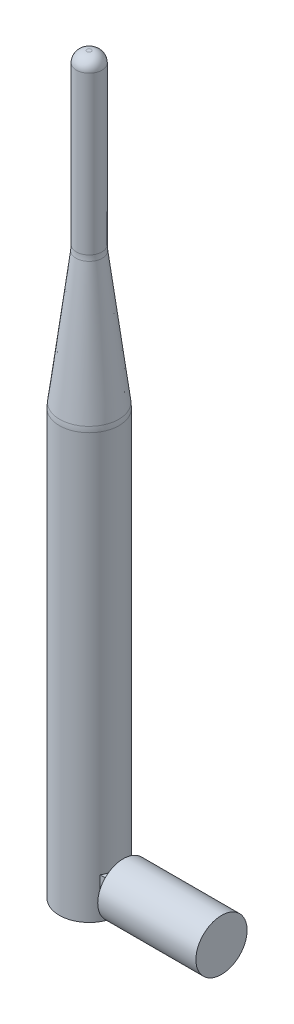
ISO-10303-21;
HEADER;
FILE_DESCRIPTION(('STEP AP214'),'2;1');
FILE_NAME('part.step','',(''),(''),'','','');
FILE_SCHEMA(('AUTOMOTIVE_DESIGN { 1 0 10303 214 1 1 1 1 }'));
ENDSEC;
DATA;
#1=APPLICATION_CONTEXT('core data for automotive mechanical design processes');
#2=APPLICATION_PROTOCOL_DEFINITION('international standard','automotive_design',2000,#1);
#3=PRODUCT_CONTEXT('',#1,'mechanical');
#4=PRODUCT('Part','Part','',(#3));
#5=PRODUCT_RELATED_PRODUCT_CATEGORY('part','',(#4));
#6=PRODUCT_DEFINITION_FORMATION('','',#4);
#7=PRODUCT_DEFINITION_CONTEXT('part definition',#1,'design');
#8=PRODUCT_DEFINITION('design','',#6,#7);
#9=PRODUCT_DEFINITION_SHAPE('','',#8);
#10=(LENGTH_UNIT() NAMED_UNIT(*) SI_UNIT(.MILLI.,.METRE.));
#11=(NAMED_UNIT(*) PLANE_ANGLE_UNIT() SI_UNIT($,.RADIAN.));
#12=(NAMED_UNIT(*) SI_UNIT($,.STERADIAN.) SOLID_ANGLE_UNIT());
#13=UNCERTAINTY_MEASURE_WITH_UNIT(LENGTH_MEASURE(1.E-05),#10,'distance_accuracy_value','');
#14=(GEOMETRIC_REPRESENTATION_CONTEXT(3) GLOBAL_UNCERTAINTY_ASSIGNED_CONTEXT((#13)) GLOBAL_UNIT_ASSIGNED_CONTEXT((#10,
#11,#12)) REPRESENTATION_CONTEXT('',''));
#15=CARTESIAN_POINT('',(0.,0.,0.));
#16=DIRECTION('',(0.,0.,1.));
#17=DIRECTION('',(1.,0.,0.));
#18=AXIS2_PLACEMENT_3D('',#15,#16,#17);
#19=CARTESIAN_POINT('',(0.,0.,0.));
#20=DIRECTION('',(0.,-1.,0.));
#21=DIRECTION('',(0.,0.,-1.));
#22=AXIS2_PLACEMENT_3D('',#19,#20,#21);
#23=CYLINDRICAL_SURFACE('',#22,7.);
#24=CARTESIAN_POINT('',(0.,99.3774225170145,0.));
#25=DIRECTION('',(0.,-1.,0.));
#26=DIRECTION('',(0.,0.,-1.));
#27=AXIS2_PLACEMENT_3D('',#24,#25,#26);
#28=CIRCLE('',#27,7.);
#29=CARTESIAN_POINT('',(0.,99.3774225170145,-7.));
#30=VERTEX_POINT('',#29);
#31=EDGE_CURVE('E118',#30,#30,#28,.T.);
#32=ORIENTED_EDGE('',*,*,#31,.T.);
#33=EDGE_LOOP('',(#32));
#34=FACE_BOUND('',#33,.T.);
#35=CARTESIAN_POINT('',(0.,0.,0.));
#36=DIRECTION('',(0.,-1.,0.));
#37=DIRECTION('',(0.,0.,-1.));
#38=AXIS2_PLACEMENT_3D('',#35,#36,#37);
#39=CIRCLE('',#38,7.);
#40=CARTESIAN_POINT('',(0.,0.,-7.));
#41=VERTEX_POINT('',#40);
#42=EDGE_CURVE('E121',#41,#41,#39,.T.);
#43=ORIENTED_EDGE('',*,*,#42,.F.);
#44=EDGE_LOOP('',(#43));
#45=FACE_BOUND('',#44,.T.);
#46=CARTESIAN_POINT('',(0.,2.5,0.));
#47=DIRECTION('',(0.,1.,0.));
#48=DIRECTION('',(0.,0.,1.));
#49=AXIS2_PLACEMENT_3D('',#46,#47,#48);
#50=CIRCLE('',#49,7.);
#51=CARTESIAN_POINT('',(6.06217782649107,2.5,-3.5));
#52=VERTEX_POINT('',#51);
#53=CARTESIAN_POINT('',(6.06217782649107,2.5,3.5));
#54=VERTEX_POINT('',#53);
#55=EDGE_CURVE('E124',#52,#54,#50,.F.);
#56=ORIENTED_EDGE('',*,*,#55,.T.);
#57=DIRECTION('',(0.,-1.,0.));
#58=VECTOR('',#57,1.);
#59=CARTESIAN_POINT('',(6.06217782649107,0.,3.5));
#60=LINE('',#59,#58);
#61=CARTESIAN_POINT('',(6.06217782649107,9.5,3.5));
#62=VERTEX_POINT('',#61);
#63=EDGE_CURVE('E11',#54,#62,#60,.F.);
#64=ORIENTED_EDGE('',*,*,#63,.T.);
#65=CARTESIAN_POINT('',(0.,9.5,0.));
#66=DIRECTION('',(0.,-1.,0.));
#67=DIRECTION('',(0.,0.,-1.));
#68=AXIS2_PLACEMENT_3D('',#65,#66,#67);
#69=CIRCLE('',#68,7.);
#70=CARTESIAN_POINT('',(6.06217782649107,9.5,-3.5));
#71=VERTEX_POINT('',#70);
#72=EDGE_CURVE('E40',#62,#71,#69,.F.);
#73=ORIENTED_EDGE('',*,*,#72,.T.);
#74=DIRECTION('',(0.,-1.,0.));
#75=VECTOR('',#74,1.);
#76=CARTESIAN_POINT('',(6.06217782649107,0.,-3.5));
#77=LINE('',#76,#75);
#78=EDGE_CURVE('E127',#71,#52,#77,.T.);
#79=ORIENTED_EDGE('',*,*,#78,.T.);
#80=EDGE_LOOP('',(#56,#64,#73,#79));
#81=FACE_BOUND('',#80,.T.);
#82=ADVANCED_FACE('F32',(#34,#45,#81),#23,.T.);
#83=CARTESIAN_POINT('',(0.,0.,0.));
#84=DIRECTION('',(0.,-1.,0.));
#85=DIRECTION('',(0.,0.,-1.));
#86=AXIS2_PLACEMENT_3D('',#83,#84,#85);
#87=PLANE('',#86);
#88=ORIENTED_EDGE('',*,*,#42,.T.);
#89=EDGE_LOOP('',(#88));
#90=FACE_BOUND('',#89,.T.);
#91=ADVANCED_FACE('F34',(#90),#87,.T.);
#92=CARTESIAN_POINT('',(0.,99.3774225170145,0.));
#93=DIRECTION('',(0.,-1.,0.));
#94=DIRECTION('',(0.,0.,-1.));
#95=AXIS2_PLACEMENT_3D('',#92,#93,#94);
#96=DEGENERATE_TOROIDAL_SURFACE('',#95,3.,10.,.F.);
#97=CARTESIAN_POINT('',(0.,100.617769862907,0.));
#98=DIRECTION('',(0.,-1.,0.));
#99=DIRECTION('',(0.,0.,-1.));
#100=AXIS2_PLACEMENT_3D('',#97,#98,#99);
#101=CIRCLE('',#100,6.92277876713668);
#102=CARTESIAN_POINT('',(0.,100.617769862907,-6.92277876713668));
#103=VERTEX_POINT('',#102);
#104=EDGE_CURVE('E115',#103,#103,#101,.T.);
#105=ORIENTED_EDGE('',*,*,#104,.T.);
#106=EDGE_LOOP('',(#105));
#107=FACE_BOUND('',#106,.T.);
#108=ORIENTED_EDGE('',*,*,#31,.F.);
#109=EDGE_LOOP('',(#108));
#110=FACE_BOUND('',#109,.T.);
#111=ADVANCED_FACE('F147',(#107,#110),#96,.F.);
#112=CARTESIAN_POINT('',(0.,100.617769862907,0.));
#113=DIRECTION('',(0.,-1.,0.));
#114=DIRECTION('',(0.,0.,-1.));
#115=AXIS2_PLACEMENT_3D('',#112,#113,#114);
#116=CONICAL_SURFACE('',#115,6.92277876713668,0.124354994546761);
#117=CARTESIAN_POINT('',(0.,131.382230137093,0.));
#118=DIRECTION('',(0.,-1.,0.));
#119=DIRECTION('',(0.,0.,-1.));
#120=AXIS2_PLACEMENT_3D('',#117,#118,#119);
#121=CIRCLE('',#120,3.07722123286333);
#122=CARTESIAN_POINT('',(0.,131.382230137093,-3.07722123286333));
#123=VERTEX_POINT('',#122);
#124=EDGE_CURVE('E112',#123,#123,#121,.T.);
#125=ORIENTED_EDGE('',*,*,#124,.T.);
#126=EDGE_LOOP('',(#125));
#127=FACE_BOUND('',#126,.T.);
#128=ORIENTED_EDGE('',*,*,#104,.F.);
#129=EDGE_LOOP('',(#128));
#130=FACE_BOUND('',#129,.T.);
#131=ADVANCED_FACE('F153',(#127,#130),#116,.T.);
#132=CARTESIAN_POINT('',(0.,132.622577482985,0.));
#133=DIRECTION('',(0.,-1.,0.));
#134=DIRECTION('',(0.,0.,-1.));
#135=AXIS2_PLACEMENT_3D('',#132,#133,#134);
#136=TOROIDAL_SURFACE('',#135,13.,10.);
#137=CARTESIAN_POINT('',(0.,132.622577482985,0.));
#138=DIRECTION('',(0.,-1.,0.));
#139=DIRECTION('',(0.,0.,-1.));
#140=AXIS2_PLACEMENT_3D('',#137,#138,#139);
#141=CIRCLE('',#140,3.);
#142=CARTESIAN_POINT('',(0.,132.622577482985,-3.));
#143=VERTEX_POINT('',#142);
#144=EDGE_CURVE('E109',#143,#143,#141,.T.);
#145=ORIENTED_EDGE('',*,*,#144,.T.);
#146=EDGE_LOOP('',(#145));
#147=FACE_BOUND('',#146,.T.);
#148=ORIENTED_EDGE('',*,*,#124,.F.);
#149=EDGE_LOOP('',(#148));
#150=FACE_BOUND('',#149,.T.);
#151=ADVANCED_FACE('F157',(#147,#150),#136,.F.);
#152=CARTESIAN_POINT('',(0.,0.,0.));
#153=DIRECTION('',(0.,-1.,0.));
#154=DIRECTION('',(0.,0.,-1.));
#155=AXIS2_PLACEMENT_3D('',#152,#153,#154);
#156=CYLINDRICAL_SURFACE('',#155,3.);
#157=CARTESIAN_POINT('',(0.,169.5,0.));
#158=DIRECTION('',(0.,-1.,0.));
#159=DIRECTION('',(0.,0.,-1.));
#160=AXIS2_PLACEMENT_3D('',#157,#158,#159);
#161=CIRCLE('',#160,3.);
#162=CARTESIAN_POINT('',(0.,169.5,-3.));
#163=VERTEX_POINT('',#162);
#164=EDGE_CURVE('E106',#163,#163,#161,.T.);
#165=ORIENTED_EDGE('',*,*,#164,.T.);
#166=EDGE_LOOP('',(#165));
#167=FACE_BOUND('',#166,.T.);
#168=ORIENTED_EDGE('',*,*,#144,.F.);
#169=EDGE_LOOP('',(#168));
#170=FACE_BOUND('',#169,.T.);
#171=ADVANCED_FACE('F161',(#167,#170),#156,.T.);
#172=CARTESIAN_POINT('',(0.,169.5,0.));
#173=DIRECTION('',(0.,-1.,0.));
#174=DIRECTION('',(0.,0.,-1.));
#175=AXIS2_PLACEMENT_3D('',#172,#173,#174);
#176=DEGENERATE_TOROIDAL_SURFACE('',#175,0.500000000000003,2.5,.T.);
#177=CARTESIAN_POINT('',(0.,172.,0.));
#178=DIRECTION('',(0.,-1.,0.));
#179=DIRECTION('',(0.,0.,-1.));
#180=AXIS2_PLACEMENT_3D('',#177,#178,#179);
#181=CIRCLE('',#180,0.500000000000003);
#182=CARTESIAN_POINT('',(0.,172.,-0.500000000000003));
#183=VERTEX_POINT('',#182);
#184=EDGE_CURVE('E85',#183,#183,#181,.T.);
#185=ORIENTED_EDGE('',*,*,#184,.T.);
#186=EDGE_LOOP('',(#185));
#187=FACE_BOUND('',#186,.T.);
#188=ORIENTED_EDGE('',*,*,#164,.F.);
#189=EDGE_LOOP('',(#188));
#190=FACE_BOUND('',#189,.T.);
#191=ADVANCED_FACE('F165',(#187,#190),#176,.T.);
#192=CARTESIAN_POINT('',(0.,172.,0.));
#193=DIRECTION('',(0.,1.,0.));
#194=DIRECTION('',(0.,0.,1.));
#195=AXIS2_PLACEMENT_3D('',#192,#193,#194);
#196=PLANE('',#195);
#197=ORIENTED_EDGE('',*,*,#184,.F.);
#198=EDGE_LOOP('',(#197));
#199=FACE_BOUND('',#198,.T.);
#200=ADVANCED_FACE('F169',(#199),#196,.T.);
#201=CARTESIAN_POINT('',(-2.,2.5,3.5));
#202=DIRECTION('',(0.,0.,-1.));
#203=DIRECTION('',(-1.,0.,0.));
#204=AXIS2_PLACEMENT_3D('',#201,#202,#203);
#205=PLANE('',#204);
#206=ORIENTED_EDGE('',*,*,#63,.F.);
#207=DIRECTION('',(1.,0.,0.));
#208=VECTOR('',#207,1.);
#209=CARTESIAN_POINT('',(-2.,2.5,3.5));
#210=LINE('',#209,#208);
#211=CARTESIAN_POINT('',(8.,2.5,3.5));
#212=VERTEX_POINT('',#211);
#213=EDGE_CURVE('E47',#54,#212,#210,.T.);
#214=ORIENTED_EDGE('',*,*,#213,.T.);
#215=DIRECTION('',(0.,1.,0.));
#216=VECTOR('',#215,1.);
#217=CARTESIAN_POINT('',(8.,2.5,3.5));
#218=LINE('',#217,#216);
#219=CARTESIAN_POINT('',(8.,9.5,3.5));
#220=VERTEX_POINT('',#219);
#221=EDGE_CURVE('E77',#212,#220,#218,.T.);
#222=ORIENTED_EDGE('',*,*,#221,.T.);
#223=DIRECTION('',(1.,0.,0.));
#224=VECTOR('',#223,1.);
#225=CARTESIAN_POINT('',(-2.,9.5,3.5));
#226=LINE('',#225,#224);
#227=EDGE_CURVE('E82',#62,#220,#226,.T.);
#228=ORIENTED_EDGE('',*,*,#227,.F.);
#229=EDGE_LOOP('',(#206,#214,#222,#228));
#230=FACE_BOUND('',#229,.T.);
#231=ADVANCED_FACE('F88',(#230),#205,.F.);
#232=CARTESIAN_POINT('',(-2.,9.5,3.5));
#233=DIRECTION('',(0.,-1.,0.));
#234=DIRECTION('',(0.,0.,-1.));
#235=AXIS2_PLACEMENT_3D('',#232,#233,#234);
#236=PLANE('',#235);
#237=ORIENTED_EDGE('',*,*,#72,.F.);
#238=ORIENTED_EDGE('',*,*,#227,.T.);
#239=DIRECTION('',(0.,0.,-1.));
#240=VECTOR('',#239,1.);
#241=CARTESIAN_POINT('',(8.,9.5,3.5));
#242=LINE('',#241,#240);
#243=CARTESIAN_POINT('',(8.,9.5,-3.5));
#244=VERTEX_POINT('',#243);
#245=EDGE_CURVE('E74',#220,#244,#242,.T.);
#246=ORIENTED_EDGE('',*,*,#245,.T.);
#247=DIRECTION('',(1.,0.,0.));
#248=VECTOR('',#247,1.);
#249=CARTESIAN_POINT('',(-2.,9.5,-3.5));
#250=LINE('',#249,#248);
#251=EDGE_CURVE('E86',#71,#244,#250,.T.);
#252=ORIENTED_EDGE('',*,*,#251,.F.);
#253=EDGE_LOOP('',(#237,#238,#246,#252));
#254=FACE_BOUND('',#253,.T.);
#255=ADVANCED_FACE('F83',(#254),#236,.F.);
#256=CARTESIAN_POINT('',(-2.,2.5,-3.5));
#257=DIRECTION('',(0.,0.,1.));
#258=DIRECTION('',(1.,0.,0.));
#259=AXIS2_PLACEMENT_3D('',#256,#257,#258);
#260=PLANE('',#259);
#261=ORIENTED_EDGE('',*,*,#78,.F.);
#262=ORIENTED_EDGE('',*,*,#251,.T.);
#263=DIRECTION('',(0.,-1.,0.));
#264=VECTOR('',#263,1.);
#265=CARTESIAN_POINT('',(8.,2.5,-3.5));
#266=LINE('',#265,#264);
#267=CARTESIAN_POINT('',(8.,2.5,-3.5));
#268=VERTEX_POINT('',#267);
#269=EDGE_CURVE('E79',#244,#268,#266,.T.);
#270=ORIENTED_EDGE('',*,*,#269,.T.);
#271=DIRECTION('',(1.,0.,0.));
#272=VECTOR('',#271,1.);
#273=CARTESIAN_POINT('',(-2.,2.5,-3.5));
#274=LINE('',#273,#272);
#275=EDGE_CURVE('E100',#52,#268,#274,.T.);
#276=ORIENTED_EDGE('',*,*,#275,.F.);
#277=EDGE_LOOP('',(#261,#262,#270,#276));
#278=FACE_BOUND('',#277,.T.);
#279=ADVANCED_FACE('F133',(#278),#260,.F.);
#280=CARTESIAN_POINT('',(-2.,2.5,3.5));
#281=DIRECTION('',(0.,1.,0.));
#282=DIRECTION('',(0.,0.,1.));
#283=AXIS2_PLACEMENT_3D('',#280,#281,#282);
#284=PLANE('',#283);
#285=ORIENTED_EDGE('',*,*,#55,.F.);
#286=ORIENTED_EDGE('',*,*,#275,.T.);
#287=DIRECTION('',(0.,0.,1.));
#288=VECTOR('',#287,1.);
#289=CARTESIAN_POINT('',(8.,2.5,3.5));
#290=LINE('',#289,#288);
#291=EDGE_CURVE('E97',#268,#212,#290,.T.);
#292=ORIENTED_EDGE('',*,*,#291,.T.);
#293=ORIENTED_EDGE('',*,*,#213,.F.);
#294=EDGE_LOOP('',(#285,#286,#292,#293));
#295=FACE_BOUND('',#294,.T.);
#296=ADVANCED_FACE('F131',(#295),#284,.F.);
#297=CARTESIAN_POINT('',(8.,0.,0.));
#298=DIRECTION('',(-1.,0.,0.));
#299=DIRECTION('',(0.,0.,1.));
#300=AXIS2_PLACEMENT_3D('',#297,#298,#299);
#301=PLANE('',#300);
#302=CARTESIAN_POINT('',(8.,6.,0.));
#303=DIRECTION('',(-1.,0.,0.));
#304=DIRECTION('',(0.,0.,1.));
#305=AXIS2_PLACEMENT_3D('',#302,#303,#304);
#306=CIRCLE('',#305,6.);
#307=CARTESIAN_POINT('',(8.,6.,6.));
#308=VERTEX_POINT('',#307);
#309=EDGE_CURVE('E92',#308,#308,#306,.T.);
#310=ORIENTED_EDGE('',*,*,#309,.T.);
#311=EDGE_LOOP('',(#310));
#312=FACE_BOUND('',#311,.T.);
#313=ORIENTED_EDGE('',*,*,#221,.F.);
#314=ORIENTED_EDGE('',*,*,#291,.F.);
#315=ORIENTED_EDGE('',*,*,#269,.F.);
#316=ORIENTED_EDGE('',*,*,#245,.F.);
#317=EDGE_LOOP('',(#313,#314,#315,#316));
#318=FACE_BOUND('',#317,.T.);
#319=ADVANCED_FACE('F75',(#312,#318),#301,.T.);
#320=CARTESIAN_POINT('',(31.,0.,0.));
#321=DIRECTION('',(1.,0.,0.));
#322=DIRECTION('',(0.,0.,-1.));
#323=AXIS2_PLACEMENT_3D('',#320,#321,#322);
#324=PLANE('',#323);
#325=CARTESIAN_POINT('',(31.,6.,0.));
#326=DIRECTION('',(-1.,0.,0.));
#327=DIRECTION('',(0.,0.,1.));
#328=AXIS2_PLACEMENT_3D('',#325,#326,#327);
#329=CIRCLE('',#328,6.);
#330=CARTESIAN_POINT('',(31.,6.,6.));
#331=VERTEX_POINT('',#330);
#332=EDGE_CURVE('E89',#331,#331,#329,.T.);
#333=ORIENTED_EDGE('',*,*,#332,.F.);
#334=EDGE_LOOP('',(#333));
#335=FACE_BOUND('',#334,.T.);
#336=ADVANCED_FACE('F202',(#335),#324,.T.);
#337=CARTESIAN_POINT('',(8.,6.,0.));
#338=DIRECTION('',(-1.,0.,0.));
#339=DIRECTION('',(0.,0.,1.));
#340=AXIS2_PLACEMENT_3D('',#337,#338,#339);
#341=CYLINDRICAL_SURFACE('',#340,6.);
#342=ORIENTED_EDGE('',*,*,#332,.T.);
#343=EDGE_LOOP('',(#342));
#344=FACE_BOUND('',#343,.T.);
#345=ORIENTED_EDGE('',*,*,#309,.F.);
#346=EDGE_LOOP('',(#345));
#347=FACE_BOUND('',#346,.T.);
#348=ADVANCED_FACE('F213',(#344,#347),#341,.T.);
#349=CLOSED_SHELL('',(#82,#91,#111,#131,#151,#171,#191,#200,#231,#255,#279,#296,#319,#336,#348));
#350=MANIFOLD_SOLID_BREP('B2',#349);
#351=ADVANCED_BREP_SHAPE_REPRESENTATION('',(#18,#350),#14);
#352=SHAPE_DEFINITION_REPRESENTATION(#9,#351);
ENDSEC;
END-ISO-10303-21;
